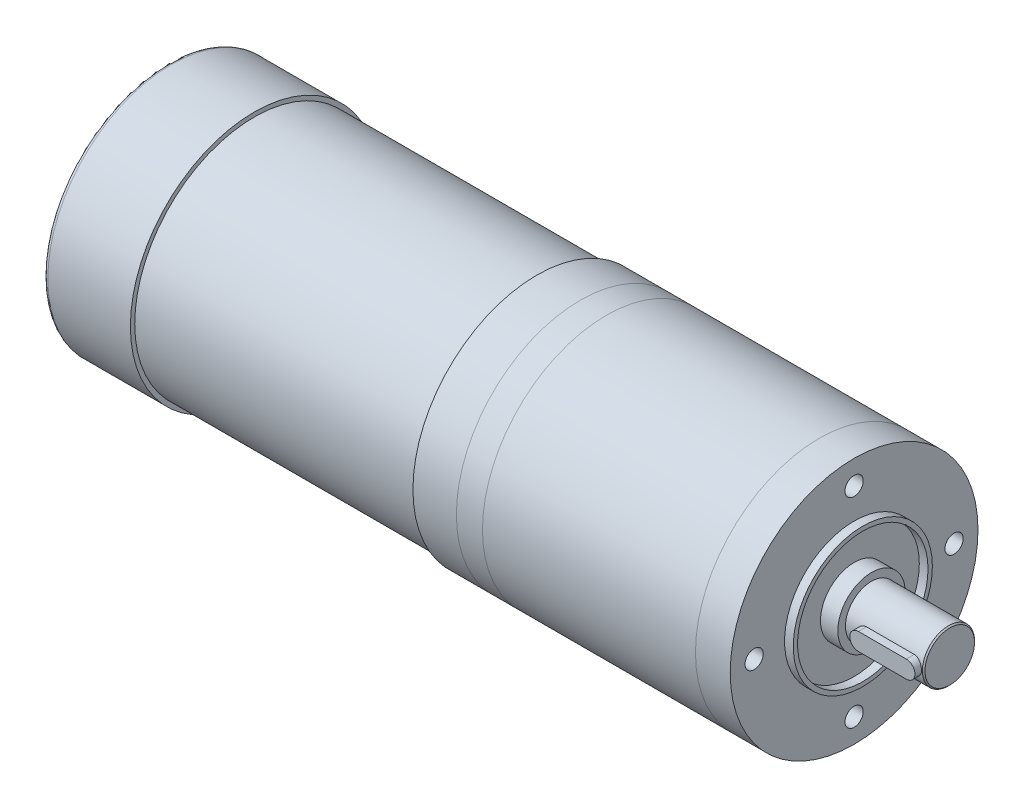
ISO-10303-21;
HEADER;
FILE_DESCRIPTION(('STEP AP214'),'2;1');
FILE_NAME('part.step','',(''),(''),'','','');
FILE_SCHEMA(('AUTOMOTIVE_DESIGN { 1 0 10303 214 1 1 1 1 }'));
ENDSEC;
DATA;
#1=APPLICATION_CONTEXT('core data for automotive mechanical design processes');
#2=APPLICATION_PROTOCOL_DEFINITION('international standard','automotive_design',2000,#1);
#3=PRODUCT_CONTEXT('',#1,'mechanical');
#4=PRODUCT('Part','Part','',(#3));
#5=PRODUCT_RELATED_PRODUCT_CATEGORY('part','',(#4));
#6=PRODUCT_DEFINITION_FORMATION('','',#4);
#7=PRODUCT_DEFINITION_CONTEXT('part definition',#1,'design');
#8=PRODUCT_DEFINITION('design','',#6,#7);
#9=PRODUCT_DEFINITION_SHAPE('','',#8);
#10=(LENGTH_UNIT() NAMED_UNIT(*) SI_UNIT(.MILLI.,.METRE.));
#11=(NAMED_UNIT(*) PLANE_ANGLE_UNIT() SI_UNIT($,.RADIAN.));
#12=(NAMED_UNIT(*) SI_UNIT($,.STERADIAN.) SOLID_ANGLE_UNIT());
#13=UNCERTAINTY_MEASURE_WITH_UNIT(LENGTH_MEASURE(1.E-05),#10,'distance_accuracy_value','');
#14=(GEOMETRIC_REPRESENTATION_CONTEXT(3) GLOBAL_UNCERTAINTY_ASSIGNED_CONTEXT((#13)) GLOBAL_UNIT_ASSIGNED_CONTEXT((#10,
#11,#12)) REPRESENTATION_CONTEXT('',''));
#15=CARTESIAN_POINT('',(0.,0.,0.));
#16=DIRECTION('',(0.,0.,1.));
#17=DIRECTION('',(1.,0.,0.));
#18=AXIS2_PLACEMENT_3D('',#15,#16,#17);
#19=CARTESIAN_POINT('',(8.5,0.,7.5));
#20=DIRECTION('',(0.,0.,-1.));
#21=DIRECTION('',(-1.,0.,0.));
#22=AXIS2_PLACEMENT_3D('',#19,#20,#21);
#23=CYLINDRICAL_SURFACE('',#22,2.);
#24=CARTESIAN_POINT('',(8.5,0.,3.5));
#25=DIRECTION('',(0.,0.,1.));
#26=DIRECTION('',(1.,0.,0.));
#27=AXIS2_PLACEMENT_3D('',#24,#25,#26);
#28=CIRCLE('',#27,2.);
#29=CARTESIAN_POINT('',(8.5,2.,3.5));
#30=VERTEX_POINT('',#29);
#31=CARTESIAN_POINT('',(8.5,-2.,3.5));
#32=VERTEX_POINT('',#31);
#33=EDGE_CURVE('E111',#30,#32,#28,.T.);
#34=ORIENTED_EDGE('',*,*,#33,.T.);
#35=DIRECTION('',(0.,0.,-1.));
#36=VECTOR('',#35,1.);
#37=CARTESIAN_POINT('',(8.5,-2.,7.5));
#38=LINE('',#37,#36);
#39=CARTESIAN_POINT('',(8.5,-2.,7.5));
#40=VERTEX_POINT('',#39);
#41=EDGE_CURVE('E12',#40,#32,#38,.T.);
#42=ORIENTED_EDGE('',*,*,#41,.F.);
#43=CARTESIAN_POINT('',(8.5,0.,7.5));
#44=DIRECTION('',(0.,0.,1.));
#45=DIRECTION('',(1.,0.,0.));
#46=AXIS2_PLACEMENT_3D('',#43,#44,#45);
#47=CIRCLE('',#46,2.);
#48=CARTESIAN_POINT('',(8.5,2.,7.5));
#49=VERTEX_POINT('',#48);
#50=EDGE_CURVE('E99',#49,#40,#47,.T.);
#51=ORIENTED_EDGE('',*,*,#50,.F.);
#52=DIRECTION('',(0.,0.,-1.));
#53=VECTOR('',#52,1.);
#54=CARTESIAN_POINT('',(8.5,2.,7.5));
#55=LINE('',#54,#53);
#56=EDGE_CURVE('E107',#49,#30,#55,.T.);
#57=ORIENTED_EDGE('',*,*,#56,.T.);
#58=EDGE_LOOP('',(#34,#42,#51,#57));
#59=FACE_BOUND('',#58,.T.);
#60=ADVANCED_FACE('F48',(#59),#23,.T.);
#61=CARTESIAN_POINT('',(19.5,-2.,7.5));
#62=DIRECTION('',(0.,1.,0.));
#63=DIRECTION('',(-1.,0.,0.));
#64=AXIS2_PLACEMENT_3D('',#61,#62,#63);
#65=PLANE('',#64);
#66=DIRECTION('',(1.,0.,0.));
#67=VECTOR('',#66,1.);
#68=CARTESIAN_POINT('',(19.5,-2.,3.5));
#69=LINE('',#68,#67);
#70=CARTESIAN_POINT('',(19.5,-2.,3.5));
#71=VERTEX_POINT('',#70);
#72=EDGE_CURVE('E103',#32,#71,#69,.T.);
#73=ORIENTED_EDGE('',*,*,#72,.T.);
#74=DIRECTION('',(0.,0.,-1.));
#75=VECTOR('',#74,1.);
#76=CARTESIAN_POINT('',(19.5,-2.,7.5));
#77=LINE('',#76,#75);
#78=CARTESIAN_POINT('',(19.5,-2.,7.5));
#79=VERTEX_POINT('',#78);
#80=EDGE_CURVE('E56',#79,#71,#77,.T.);
#81=ORIENTED_EDGE('',*,*,#80,.F.);
#82=DIRECTION('',(1.,0.,0.));
#83=VECTOR('',#82,1.);
#84=CARTESIAN_POINT('',(19.5,-2.,7.5));
#85=LINE('',#84,#83);
#86=EDGE_CURVE('E94',#40,#79,#85,.T.);
#87=ORIENTED_EDGE('',*,*,#86,.F.);
#88=ORIENTED_EDGE('',*,*,#41,.T.);
#89=EDGE_LOOP('',(#73,#81,#87,#88));
#90=FACE_BOUND('',#89,.T.);
#91=ADVANCED_FACE('F102',(#90),#65,.F.);
#92=CARTESIAN_POINT('',(19.5,0.,7.5));
#93=DIRECTION('',(0.,0.,-1.));
#94=DIRECTION('',(-1.,0.,0.));
#95=AXIS2_PLACEMENT_3D('',#92,#93,#94);
#96=CYLINDRICAL_SURFACE('',#95,2.);
#97=CARTESIAN_POINT('',(19.5,0.,3.5));
#98=DIRECTION('',(0.,0.,1.));
#99=DIRECTION('',(1.,0.,0.));
#100=AXIS2_PLACEMENT_3D('',#97,#98,#99);
#101=CIRCLE('',#100,2.);
#102=CARTESIAN_POINT('',(19.5,2.,3.5));
#103=VERTEX_POINT('',#102);
#104=EDGE_CURVE('E81',#71,#103,#101,.T.);
#105=ORIENTED_EDGE('',*,*,#104,.T.);
#106=DIRECTION('',(0.,0.,-1.));
#107=VECTOR('',#106,1.);
#108=CARTESIAN_POINT('',(19.5,2.,7.5));
#109=LINE('',#108,#107);
#110=CARTESIAN_POINT('',(19.5,2.,7.5));
#111=VERTEX_POINT('',#110);
#112=EDGE_CURVE('E104',#111,#103,#109,.T.);
#113=ORIENTED_EDGE('',*,*,#112,.F.);
#114=CARTESIAN_POINT('',(19.5,0.,7.5));
#115=DIRECTION('',(0.,0.,1.));
#116=DIRECTION('',(1.,0.,0.));
#117=AXIS2_PLACEMENT_3D('',#114,#115,#116);
#118=CIRCLE('',#117,2.);
#119=EDGE_CURVE('E97',#79,#111,#118,.T.);
#120=ORIENTED_EDGE('',*,*,#119,.F.);
#121=ORIENTED_EDGE('',*,*,#80,.T.);
#122=EDGE_LOOP('',(#105,#113,#120,#121));
#123=FACE_BOUND('',#122,.T.);
#124=ADVANCED_FACE('F105',(#123),#96,.T.);
#125=CARTESIAN_POINT('',(8.5,2.,7.5));
#126=DIRECTION('',(0.,-1.,0.));
#127=DIRECTION('',(1.,0.,0.));
#128=AXIS2_PLACEMENT_3D('',#125,#126,#127);
#129=PLANE('',#128);
#130=DIRECTION('',(-1.,0.,0.));
#131=VECTOR('',#130,1.);
#132=CARTESIAN_POINT('',(8.5,2.,3.5));
#133=LINE('',#132,#131);
#134=EDGE_CURVE('E87',#103,#30,#133,.T.);
#135=ORIENTED_EDGE('',*,*,#134,.T.);
#136=ORIENTED_EDGE('',*,*,#56,.F.);
#137=DIRECTION('',(-1.,0.,0.));
#138=VECTOR('',#137,1.);
#139=CARTESIAN_POINT('',(8.5,2.,7.5));
#140=LINE('',#139,#138);
#141=EDGE_CURVE('E64',#111,#49,#140,.T.);
#142=ORIENTED_EDGE('',*,*,#141,.F.);
#143=ORIENTED_EDGE('',*,*,#112,.T.);
#144=EDGE_LOOP('',(#135,#136,#142,#143));
#145=FACE_BOUND('',#144,.T.);
#146=ADVANCED_FACE('F118',(#145),#129,.F.);
#147=CARTESIAN_POINT('',(8.5,0.,7.5));
#148=DIRECTION('',(0.,0.,1.));
#149=DIRECTION('',(1.,0.,0.));
#150=AXIS2_PLACEMENT_3D('',#147,#148,#149);
#151=PLANE('',#150);
#152=ORIENTED_EDGE('',*,*,#50,.T.);
#153=ORIENTED_EDGE('',*,*,#86,.T.);
#154=ORIENTED_EDGE('',*,*,#119,.T.);
#155=ORIENTED_EDGE('',*,*,#141,.T.);
#156=EDGE_LOOP('',(#152,#153,#154,#155));
#157=FACE_BOUND('',#156,.T.);
#158=ADVANCED_FACE('F95',(#157),#151,.T.);
#159=CARTESIAN_POINT('',(8.5,0.,3.5));
#160=DIRECTION('',(0.,0.,1.));
#161=DIRECTION('',(1.,0.,0.));
#162=AXIS2_PLACEMENT_3D('',#159,#160,#161);
#163=PLANE('',#162);
#164=ORIENTED_EDGE('',*,*,#33,.F.);
#165=ORIENTED_EDGE('',*,*,#134,.F.);
#166=ORIENTED_EDGE('',*,*,#104,.F.);
#167=ORIENTED_EDGE('',*,*,#72,.F.);
#168=EDGE_LOOP('',(#164,#165,#166,#167));
#169=FACE_BOUND('',#168,.T.);
#170=ADVANCED_FACE('F121',(#169),#163,.F.);
#171=CLOSED_SHELL('',(#60,#91,#124,#146,#158,#170));
#172=MANIFOLD_SOLID_BREP('B2',#171);
#173=CARTESIAN_POINT('',(-73.,0.,0.));
#174=DIRECTION('',(-1.,0.,0.));
#175=DIRECTION('',(0.,0.,1.));
#176=AXIS2_PLACEMENT_3D('',#173,#174,#175);
#177=PLANE('',#176);
#178=CARTESIAN_POINT('',(-73.,0.,0.));
#179=DIRECTION('',(-1.,0.,0.));
#180=DIRECTION('',(0.,0.,1.));
#181=AXIS2_PLACEMENT_3D('',#178,#179,#180);
#182=CIRCLE('',#181,28.5);
#183=CARTESIAN_POINT('',(-73.,0.,28.5));
#184=VERTEX_POINT('',#183);
#185=EDGE_CURVE('E191',#184,#184,#182,.T.);
#186=ORIENTED_EDGE('',*,*,#185,.T.);
#187=EDGE_LOOP('',(#186));
#188=FACE_BOUND('',#187,.T.);
#189=CARTESIAN_POINT('',(-73.,0.,0.));
#190=DIRECTION('',(-1.,0.,0.));
#191=DIRECTION('',(0.,0.,1.));
#192=AXIS2_PLACEMENT_3D('',#189,#190,#191);
#193=CIRCLE('',#192,27.5);
#194=CARTESIAN_POINT('',(-73.,0.,27.5));
#195=VERTEX_POINT('',#194);
#196=EDGE_CURVE('E201',#195,#195,#193,.T.);
#197=ORIENTED_EDGE('',*,*,#196,.F.);
#198=EDGE_LOOP('',(#197));
#199=FACE_BOUND('',#198,.T.);
#200=ADVANCED_FACE('F180',(#188,#199),#177,.T.);
#201=CARTESIAN_POINT('',(-73.,0.,0.));
#202=DIRECTION('',(1.,0.,0.));
#203=DIRECTION('',(0.,0.,-1.));
#204=AXIS2_PLACEMENT_3D('',#201,#202,#203);
#205=CYLINDRICAL_SURFACE('',#204,28.5);
#206=ORIENTED_EDGE('',*,*,#185,.F.);
#207=EDGE_LOOP('',(#206));
#208=FACE_BOUND('',#207,.T.);
#209=CARTESIAN_POINT('',(-63.,0.,0.));
#210=DIRECTION('',(-1.,0.,0.));
#211=DIRECTION('',(0.,0.,1.));
#212=AXIS2_PLACEMENT_3D('',#209,#210,#211);
#213=CIRCLE('',#212,28.5);
#214=CARTESIAN_POINT('',(-63.,0.,28.5));
#215=VERTEX_POINT('',#214);
#216=EDGE_CURVE('E195',#215,#215,#213,.T.);
#217=ORIENTED_EDGE('',*,*,#216,.T.);
#218=EDGE_LOOP('',(#217));
#219=FACE_BOUND('',#218,.T.);
#220=ADVANCED_FACE('F226',(#208,#219),#205,.T.);
#221=CARTESIAN_POINT('',(-63.,0.,0.));
#222=DIRECTION('',(-1.,0.,0.));
#223=DIRECTION('',(0.,0.,1.));
#224=AXIS2_PLACEMENT_3D('',#221,#222,#223);
#225=PLANE('',#224);
#226=ORIENTED_EDGE('',*,*,#216,.F.);
#227=EDGE_LOOP('',(#226));
#228=FACE_BOUND('',#227,.T.);
#229=ADVANCED_FACE('F221',(#228),#225,.F.);
#230=CARTESIAN_POINT('',(-138.,0.,0.));
#231=DIRECTION('',(1.,0.,0.));
#232=DIRECTION('',(0.,0.,-1.));
#233=AXIS2_PLACEMENT_3D('',#230,#231,#232);
#234=CYLINDRICAL_SURFACE('',#233,27.5);
#235=CARTESIAN_POINT('',(-138.,0.,0.));
#236=DIRECTION('',(-1.,0.,0.));
#237=DIRECTION('',(0.,0.,1.));
#238=AXIS2_PLACEMENT_3D('',#235,#236,#237);
#239=CIRCLE('',#238,27.5);
#240=CARTESIAN_POINT('',(-138.,0.,27.5));
#241=VERTEX_POINT('',#240);
#242=EDGE_CURVE('E199',#241,#241,#239,.T.);
#243=ORIENTED_EDGE('',*,*,#242,.F.);
#244=EDGE_LOOP('',(#243));
#245=FACE_BOUND('',#244,.T.);
#246=ORIENTED_EDGE('',*,*,#196,.T.);
#247=EDGE_LOOP('',(#246));
#248=FACE_BOUND('',#247,.T.);
#249=ADVANCED_FACE('F215',(#245,#248),#234,.T.);
#250=CARTESIAN_POINT('',(-138.,0.,0.));
#251=DIRECTION('',(-1.,0.,0.));
#252=DIRECTION('',(0.,0.,1.));
#253=AXIS2_PLACEMENT_3D('',#250,#251,#252);
#254=PLANE('',#253);
#255=CARTESIAN_POINT('',(-138.,0.,0.));
#256=DIRECTION('',(-1.,0.,0.));
#257=DIRECTION('',(0.,0.,1.));
#258=AXIS2_PLACEMENT_3D('',#255,#256,#257);
#259=CIRCLE('',#258,28.5);
#260=CARTESIAN_POINT('',(-138.,0.,28.5));
#261=VERTEX_POINT('',#260);
#262=EDGE_CURVE('E204',#261,#261,#259,.T.);
#263=ORIENTED_EDGE('',*,*,#262,.F.);
#264=EDGE_LOOP('',(#263));
#265=FACE_BOUND('',#264,.T.);
#266=ORIENTED_EDGE('',*,*,#242,.T.);
#267=EDGE_LOOP('',(#266));
#268=FACE_BOUND('',#267,.T.);
#269=ADVANCED_FACE('F212',(#265,#268),#254,.F.);
#270=CARTESIAN_POINT('',(-158.,0.,0.));
#271=DIRECTION('',(1.,0.,0.));
#272=DIRECTION('',(0.,0.,-1.));
#273=AXIS2_PLACEMENT_3D('',#270,#271,#272);
#274=CYLINDRICAL_SURFACE('',#273,28.5);
#275=CARTESIAN_POINT('',(-157.,0.,0.));
#276=DIRECTION('',(-1.,0.,0.));
#277=DIRECTION('',(0.,0.,1.));
#278=AXIS2_PLACEMENT_3D('',#275,#276,#277);
#279=CIRCLE('',#278,28.5);
#280=CARTESIAN_POINT('',(-157.,0.,28.5));
#281=VERTEX_POINT('',#280);
#282=EDGE_CURVE('E47',#281,#281,#279,.F.);
#283=ORIENTED_EDGE('',*,*,#282,.T.);
#284=EDGE_LOOP('',(#283));
#285=FACE_BOUND('',#284,.T.);
#286=ORIENTED_EDGE('',*,*,#262,.T.);
#287=EDGE_LOOP('',(#286));
#288=FACE_BOUND('',#287,.T.);
#289=ADVANCED_FACE('F210',(#285,#288),#274,.T.);
#290=CARTESIAN_POINT('',(-158.,0.,0.));
#291=DIRECTION('',(-1.,0.,0.));
#292=DIRECTION('',(0.,0.,1.));
#293=AXIS2_PLACEMENT_3D('',#290,#291,#292);
#294=PLANE('',#293);
#295=CARTESIAN_POINT('',(-158.,0.,0.));
#296=DIRECTION('',(-1.,0.,0.));
#297=DIRECTION('',(0.,0.,1.));
#298=AXIS2_PLACEMENT_3D('',#295,#296,#297);
#299=CIRCLE('',#298,27.5);
#300=CARTESIAN_POINT('',(-158.,0.,27.5));
#301=VERTEX_POINT('',#300);
#302=EDGE_CURVE('E187',#301,#301,#299,.T.);
#303=ORIENTED_EDGE('',*,*,#302,.T.);
#304=EDGE_LOOP('',(#303));
#305=FACE_BOUND('',#304,.T.);
#306=ADVANCED_FACE('F257',(#305),#294,.T.);
#307=CARTESIAN_POINT('',(-157.,0.,0.));
#308=DIRECTION('',(-1.,0.,0.));
#309=DIRECTION('',(0.,0.,1.));
#310=AXIS2_PLACEMENT_3D('',#307,#308,#309);
#311=TOROIDAL_SURFACE('',#310,27.5,1.);
#312=ORIENTED_EDGE('',*,*,#282,.F.);
#313=EDGE_LOOP('',(#312));
#314=FACE_BOUND('',#313,.T.);
#315=ORIENTED_EDGE('',*,*,#302,.F.);
#316=EDGE_LOOP('',(#315));
#317=FACE_BOUND('',#316,.T.);
#318=ADVANCED_FACE('F182',(#314,#317),#311,.T.);
#319=CLOSED_SHELL('',(#200,#220,#229,#249,#269,#289,#306,#318));
#320=MANIFOLD_SOLID_BREP('B6',#319);
#321=CARTESIAN_POINT('',(-63.,0.,0.));
#322=DIRECTION('',(1.,0.,0.));
#323=DIRECTION('',(0.,0.,-1.));
#324=AXIS2_PLACEMENT_3D('',#321,#322,#323);
#325=CYLINDRICAL_SURFACE('',#324,28.5);
#326=CARTESIAN_POINT('',(-63.,0.,0.));
#327=DIRECTION('',(-1.,0.,0.));
#328=DIRECTION('',(0.,0.,1.));
#329=AXIS2_PLACEMENT_3D('',#326,#327,#328);
#330=CIRCLE('',#329,28.5);
#331=CARTESIAN_POINT('',(-63.,0.,28.5));
#332=VERTEX_POINT('',#331);
#333=EDGE_CURVE('E179',#332,#332,#330,.T.);
#334=ORIENTED_EDGE('',*,*,#333,.F.);
#335=EDGE_LOOP('',(#334));
#336=FACE_BOUND('',#335,.T.);
#337=CARTESIAN_POINT('',(-57.,0.,0.));
#338=DIRECTION('',(-1.,0.,0.));
#339=DIRECTION('',(0.,0.,1.));
#340=AXIS2_PLACEMENT_3D('',#337,#338,#339);
#341=CIRCLE('',#340,28.5);
#342=CARTESIAN_POINT('',(-57.,0.,28.5));
#343=VERTEX_POINT('',#342);
#344=EDGE_CURVE('E309',#343,#343,#341,.T.);
#345=ORIENTED_EDGE('',*,*,#344,.T.);
#346=EDGE_LOOP('',(#345));
#347=FACE_BOUND('',#346,.T.);
#348=ADVANCED_FACE('F306',(#336,#347),#325,.T.);
#349=CARTESIAN_POINT('',(-63.,0.,0.));
#350=DIRECTION('',(-1.,0.,0.));
#351=DIRECTION('',(0.,0.,1.));
#352=AXIS2_PLACEMENT_3D('',#349,#350,#351);
#353=PLANE('',#352);
#354=ORIENTED_EDGE('',*,*,#333,.T.);
#355=EDGE_LOOP('',(#354));
#356=FACE_BOUND('',#355,.T.);
#357=ADVANCED_FACE('F321',(#356),#353,.T.);
#358=CARTESIAN_POINT('',(-57.,0.,0.));
#359=DIRECTION('',(-1.,0.,0.));
#360=DIRECTION('',(0.,0.,1.));
#361=AXIS2_PLACEMENT_3D('',#358,#359,#360);
#362=PLANE('',#361);
#363=ORIENTED_EDGE('',*,*,#344,.F.);
#364=EDGE_LOOP('',(#363));
#365=FACE_BOUND('',#364,.T.);
#366=ADVANCED_FACE('F319',(#365),#362,.F.);
#367=CLOSED_SHELL('',(#348,#357,#366));
#368=MANIFOLD_SOLID_BREP('B42',#367);
#369=CARTESIAN_POINT('',(-57.,0.,0.));
#370=DIRECTION('',(1.,0.,0.));
#371=DIRECTION('',(0.,0.,-1.));
#372=AXIS2_PLACEMENT_3D('',#369,#370,#371);
#373=CYLINDRICAL_SURFACE('',#372,28.5);
#374=CARTESIAN_POINT('',(-57.,0.,0.));
#375=DIRECTION('',(-1.,0.,0.));
#376=DIRECTION('',(0.,0.,1.));
#377=AXIS2_PLACEMENT_3D('',#374,#375,#376);
#378=CIRCLE('',#377,28.5);
#379=CARTESIAN_POINT('',(-57.,0.,28.5));
#380=VERTEX_POINT('',#379);
#381=EDGE_CURVE('E304',#380,#380,#378,.T.);
#382=ORIENTED_EDGE('',*,*,#381,.F.);
#383=EDGE_LOOP('',(#382));
#384=FACE_BOUND('',#383,.T.);
#385=CARTESIAN_POINT('',(-8.,0.,0.));
#386=DIRECTION('',(-1.,0.,0.));
#387=DIRECTION('',(0.,0.,1.));
#388=AXIS2_PLACEMENT_3D('',#385,#386,#387);
#389=CIRCLE('',#388,28.5);
#390=CARTESIAN_POINT('',(-8.,0.,28.5));
#391=VERTEX_POINT('',#390);
#392=EDGE_CURVE('E364',#391,#391,#389,.T.);
#393=ORIENTED_EDGE('',*,*,#392,.T.);
#394=EDGE_LOOP('',(#393));
#395=FACE_BOUND('',#394,.T.);
#396=ADVANCED_FACE('F356',(#384,#395),#373,.T.);
#397=CARTESIAN_POINT('',(-57.,0.,0.));
#398=DIRECTION('',(-1.,0.,0.));
#399=DIRECTION('',(0.,0.,1.));
#400=AXIS2_PLACEMENT_3D('',#397,#398,#399);
#401=PLANE('',#400);
#402=ORIENTED_EDGE('',*,*,#381,.T.);
#403=EDGE_LOOP('',(#402));
#404=FACE_BOUND('',#403,.T.);
#405=ADVANCED_FACE('F429',(#404),#401,.T.);
#406=CARTESIAN_POINT('',(-8.,0.,0.));
#407=DIRECTION('',(-1.,0.,0.));
#408=DIRECTION('',(0.,0.,1.));
#409=AXIS2_PLACEMENT_3D('',#406,#407,#408);
#410=PLANE('',#409);
#411=CARTESIAN_POINT('',(-8.,23.,0.));
#412=DIRECTION('',(-1.,0.,0.));
#413=DIRECTION('',(0.,0.,1.));
#414=AXIS2_PLACEMENT_3D('',#411,#412,#413);
#415=CIRCLE('',#414,2.1);
#416=CARTESIAN_POINT('',(-8.,23.,2.1));
#417=VERTEX_POINT('',#416);
#418=EDGE_CURVE('E359',#417,#417,#415,.T.);
#419=ORIENTED_EDGE('',*,*,#418,.T.);
#420=EDGE_LOOP('',(#419));
#421=FACE_BOUND('',#420,.T.);
#422=CARTESIAN_POINT('',(-8.,0.,-23.));
#423=DIRECTION('',(-1.,0.,0.));
#424=DIRECTION('',(0.,0.,1.));
#425=AXIS2_PLACEMENT_3D('',#422,#423,#424);
#426=CIRCLE('',#425,2.1);
#427=CARTESIAN_POINT('',(-8.,0.,-20.9));
#428=VERTEX_POINT('',#427);
#429=EDGE_CURVE('E393',#428,#428,#426,.T.);
#430=ORIENTED_EDGE('',*,*,#429,.T.);
#431=EDGE_LOOP('',(#430));
#432=FACE_BOUND('',#431,.T.);
#433=CARTESIAN_POINT('',(-8.,-23.,0.));
#434=DIRECTION('',(-1.,0.,0.));
#435=DIRECTION('',(0.,0.,1.));
#436=AXIS2_PLACEMENT_3D('',#433,#434,#435);
#437=CIRCLE('',#436,2.1);
#438=CARTESIAN_POINT('',(-8.,-23.,2.1));
#439=VERTEX_POINT('',#438);
#440=EDGE_CURVE('E397',#439,#439,#437,.T.);
#441=ORIENTED_EDGE('',*,*,#440,.T.);
#442=EDGE_LOOP('',(#441));
#443=FACE_BOUND('',#442,.T.);
#444=CARTESIAN_POINT('',(-8.,0.,23.));
#445=DIRECTION('',(-1.,0.,0.));
#446=DIRECTION('',(0.,0.,1.));
#447=AXIS2_PLACEMENT_3D('',#444,#445,#446);
#448=CIRCLE('',#447,2.1);
#449=CARTESIAN_POINT('',(-8.,0.,25.1));
#450=VERTEX_POINT('',#449);
#451=EDGE_CURVE('E400',#450,#450,#448,.T.);
#452=ORIENTED_EDGE('',*,*,#451,.T.);
#453=EDGE_LOOP('',(#452));
#454=FACE_BOUND('',#453,.T.);
#455=ORIENTED_EDGE('',*,*,#392,.F.);
#456=EDGE_LOOP('',(#455));
#457=FACE_BOUND('',#456,.T.);
#458=ADVANCED_FACE('F410',(#421,#432,#443,#454,#457),#410,.F.);
#459=CARTESIAN_POINT('',(0.,0.,23.));
#460=DIRECTION('',(1.,0.,0.));
#461=DIRECTION('',(0.,0.,-1.));
#462=AXIS2_PLACEMENT_3D('',#459,#460,#461);
#463=CYLINDRICAL_SURFACE('',#462,2.1);
#464=CARTESIAN_POINT('',(-14.,0.,23.));
#465=DIRECTION('',(1.,0.,0.));
#466=DIRECTION('',(0.,0.,-1.));
#467=AXIS2_PLACEMENT_3D('',#464,#465,#466);
#468=CIRCLE('',#467,2.1);
#469=CARTESIAN_POINT('',(-14.,0.,20.9));
#470=VERTEX_POINT('',#469);
#471=EDGE_CURVE('E398',#470,#470,#468,.T.);
#472=ORIENTED_EDGE('',*,*,#471,.F.);
#473=EDGE_LOOP('',(#472));
#474=FACE_BOUND('',#473,.T.);
#475=ORIENTED_EDGE('',*,*,#451,.F.);
#476=EDGE_LOOP('',(#475));
#477=FACE_BOUND('',#476,.T.);
#478=ADVANCED_FACE('F441',(#474,#477),#463,.F.);
#479=CARTESIAN_POINT('',(-14.,0.,23.));
#480=DIRECTION('',(1.,0.,0.));
#481=DIRECTION('',(0.,0.,-1.));
#482=AXIS2_PLACEMENT_3D('',#479,#480,#481);
#483=CONICAL_SURFACE('',#482,2.1,1.02974425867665);
#484=CARTESIAN_POINT('',(-15.2618072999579,0.,23.));
#485=VERTEX_POINT('',#484);
#486=VERTEX_LOOP('',#485);
#487=FACE_BOUND('',#486,.T.);
#488=ORIENTED_EDGE('',*,*,#471,.T.);
#489=EDGE_LOOP('',(#488));
#490=FACE_BOUND('',#489,.T.);
#491=ADVANCED_FACE('F446',(#487,#490),#483,.F.);
#492=CARTESIAN_POINT('',(0.,-23.,0.));
#493=DIRECTION('',(1.,0.,0.));
#494=DIRECTION('',(0.,0.,-1.));
#495=AXIS2_PLACEMENT_3D('',#492,#493,#494);
#496=CYLINDRICAL_SURFACE('',#495,2.1);
#497=CARTESIAN_POINT('',(-14.,-23.,0.));
#498=DIRECTION('',(1.,0.,0.));
#499=DIRECTION('',(0.,0.,-1.));
#500=AXIS2_PLACEMENT_3D('',#497,#498,#499);
#501=CIRCLE('',#500,2.1);
#502=CARTESIAN_POINT('',(-14.,-23.,-2.1));
#503=VERTEX_POINT('',#502);
#504=EDGE_CURVE('E394',#503,#503,#501,.T.);
#505=ORIENTED_EDGE('',*,*,#504,.F.);
#506=EDGE_LOOP('',(#505));
#507=FACE_BOUND('',#506,.T.);
#508=ORIENTED_EDGE('',*,*,#440,.F.);
#509=EDGE_LOOP('',(#508));
#510=FACE_BOUND('',#509,.T.);
#511=ADVANCED_FACE('F425',(#507,#510),#496,.F.);
#512=CARTESIAN_POINT('',(-14.,-23.,0.));
#513=DIRECTION('',(1.,0.,0.));
#514=DIRECTION('',(0.,0.,-1.));
#515=AXIS2_PLACEMENT_3D('',#512,#513,#514);
#516=CONICAL_SURFACE('',#515,2.1,1.02974425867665);
#517=CARTESIAN_POINT('',(-15.2618072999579,-23.,0.));
#518=VERTEX_POINT('',#517);
#519=VERTEX_LOOP('',#518);
#520=FACE_BOUND('',#519,.T.);
#521=ORIENTED_EDGE('',*,*,#504,.T.);
#522=EDGE_LOOP('',(#521));
#523=FACE_BOUND('',#522,.T.);
#524=ADVANCED_FACE('F416',(#520,#523),#516,.F.);
#525=CARTESIAN_POINT('',(0.,0.,-23.));
#526=DIRECTION('',(1.,0.,0.));
#527=DIRECTION('',(0.,0.,-1.));
#528=AXIS2_PLACEMENT_3D('',#525,#526,#527);
#529=CYLINDRICAL_SURFACE('',#528,2.1);
#530=CARTESIAN_POINT('',(-14.,0.,-23.));
#531=DIRECTION('',(1.,0.,0.));
#532=DIRECTION('',(0.,0.,-1.));
#533=AXIS2_PLACEMENT_3D('',#530,#531,#532);
#534=CIRCLE('',#533,2.1);
#535=CARTESIAN_POINT('',(-14.,0.,-25.1));
#536=VERTEX_POINT('',#535);
#537=EDGE_CURVE('E389',#536,#536,#534,.T.);
#538=ORIENTED_EDGE('',*,*,#537,.F.);
#539=EDGE_LOOP('',(#538));
#540=FACE_BOUND('',#539,.T.);
#541=ORIENTED_EDGE('',*,*,#429,.F.);
#542=EDGE_LOOP('',(#541));
#543=FACE_BOUND('',#542,.T.);
#544=ADVANCED_FACE('F413',(#540,#543),#529,.F.);
#545=CARTESIAN_POINT('',(-14.,0.,-23.));
#546=DIRECTION('',(1.,0.,0.));
#547=DIRECTION('',(0.,0.,-1.));
#548=AXIS2_PLACEMENT_3D('',#545,#546,#547);
#549=CONICAL_SURFACE('',#548,2.1,1.02974425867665);
#550=CARTESIAN_POINT('',(-15.2618072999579,0.,-23.));
#551=VERTEX_POINT('',#550);
#552=VERTEX_LOOP('',#551);
#553=FACE_BOUND('',#552,.T.);
#554=ORIENTED_EDGE('',*,*,#537,.T.);
#555=EDGE_LOOP('',(#554));
#556=FACE_BOUND('',#555,.T.);
#557=ADVANCED_FACE('F415',(#553,#556),#549,.F.);
#558=CARTESIAN_POINT('',(0.,23.,0.));
#559=DIRECTION('',(1.,0.,0.));
#560=DIRECTION('',(0.,0.,-1.));
#561=AXIS2_PLACEMENT_3D('',#558,#559,#560);
#562=CYLINDRICAL_SURFACE('',#561,2.1);
#563=CARTESIAN_POINT('',(-14.,23.,0.));
#564=DIRECTION('',(1.,0.,0.));
#565=DIRECTION('',(0.,0.,-1.));
#566=AXIS2_PLACEMENT_3D('',#563,#564,#565);
#567=CIRCLE('',#566,2.1);
#568=CARTESIAN_POINT('',(-14.,23.,-2.1));
#569=VERTEX_POINT('',#568);
#570=EDGE_CURVE('E385',#569,#569,#567,.T.);
#571=ORIENTED_EDGE('',*,*,#570,.F.);
#572=EDGE_LOOP('',(#571));
#573=FACE_BOUND('',#572,.T.);
#574=ORIENTED_EDGE('',*,*,#418,.F.);
#575=EDGE_LOOP('',(#574));
#576=FACE_BOUND('',#575,.T.);
#577=ADVANCED_FACE('F381',(#573,#576),#562,.F.);
#578=CARTESIAN_POINT('',(-14.,23.,0.));
#579=DIRECTION('',(1.,0.,0.));
#580=DIRECTION('',(0.,0.,-1.));
#581=AXIS2_PLACEMENT_3D('',#578,#579,#580);
#582=CONICAL_SURFACE('',#581,2.1,1.02974425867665);
#583=CARTESIAN_POINT('',(-15.2618072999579,23.,0.));
#584=VERTEX_POINT('',#583);
#585=VERTEX_LOOP('',#584);
#586=FACE_BOUND('',#585,.T.);
#587=ORIENTED_EDGE('',*,*,#570,.T.);
#588=EDGE_LOOP('',(#587));
#589=FACE_BOUND('',#588,.T.);
#590=ADVANCED_FACE('F378',(#586,#589),#582,.F.);
#591=CLOSED_SHELL('',(#396,#405,#458,#478,#491,#511,#524,#544,#557,#577,#590));
#592=MANIFOLD_SOLID_BREP('B174',#591);
#593=CARTESIAN_POINT('',(4.,0.,0.));
#594=DIRECTION('',(1.,0.,0.));
#595=DIRECTION('',(0.,0.,-1.));
#596=AXIS2_PLACEMENT_3D('',#593,#594,#595);
#597=PLANE('',#596);
#598=CARTESIAN_POINT('',(4.,0.,0.));
#599=DIRECTION('',(1.,0.,0.));
#600=DIRECTION('',(0.,0.,-1.));
#601=AXIS2_PLACEMENT_3D('',#598,#599,#600);
#602=CIRCLE('',#601,7.75);
#603=CARTESIAN_POINT('',(4.,0.,-7.75));
#604=VERTEX_POINT('',#603);
#605=EDGE_CURVE('E642',#604,#604,#602,.T.);
#606=ORIENTED_EDGE('',*,*,#605,.T.);
#607=EDGE_LOOP('',(#606));
#608=FACE_BOUND('',#607,.T.);
#609=CARTESIAN_POINT('',(4.,0.,0.));
#610=DIRECTION('',(1.,0.,0.));
#611=DIRECTION('',(0.,0.,-1.));
#612=AXIS2_PLACEMENT_3D('',#609,#610,#611);
#613=CIRCLE('',#612,6.);
#614=CARTESIAN_POINT('',(4.,0.,-6.));
#615=VERTEX_POINT('',#614);
#616=EDGE_CURVE('E638',#615,#615,#613,.T.);
#617=ORIENTED_EDGE('',*,*,#616,.F.);
#618=EDGE_LOOP('',(#617));
#619=FACE_BOUND('',#618,.T.);
#620=ADVANCED_FACE('F547',(#608,#619),#597,.T.);
#621=CARTESIAN_POINT('',(0.,0.,0.));
#622=DIRECTION('',(1.,0.,0.));
#623=DIRECTION('',(0.,0.,-1.));
#624=AXIS2_PLACEMENT_3D('',#621,#622,#623);
#625=PLANE('',#624);
#626=CARTESIAN_POINT('',(0.,0.,0.));
#627=DIRECTION('',(1.,0.,0.));
#628=DIRECTION('',(0.,0.,-1.));
#629=AXIS2_PLACEMENT_3D('',#626,#627,#628);
#630=CIRCLE('',#629,15.);
#631=CARTESIAN_POINT('',(0.,0.,-15.));
#632=VERTEX_POINT('',#631);
#633=EDGE_CURVE('E660',#632,#632,#630,.F.);
#634=ORIENTED_EDGE('',*,*,#633,.F.);
#635=EDGE_LOOP('',(#634));
#636=FACE_BOUND('',#635,.T.);
#637=CARTESIAN_POINT('',(0.,0.,0.));
#638=DIRECTION('',(1.,0.,0.));
#639=DIRECTION('',(0.,0.,-1.));
#640=AXIS2_PLACEMENT_3D('',#637,#638,#639);
#641=CIRCLE('',#640,7.75);
#642=CARTESIAN_POINT('',(0.,0.,-7.75));
#643=VERTEX_POINT('',#642);
#644=EDGE_CURVE('E641',#643,#643,#641,.T.);
#645=ORIENTED_EDGE('',*,*,#644,.F.);
#646=EDGE_LOOP('',(#645));
#647=FACE_BOUND('',#646,.T.);
#648=ADVANCED_FACE('F723',(#636,#647),#625,.T.);
#649=CARTESIAN_POINT('',(0.,23.,0.));
#650=DIRECTION('',(1.,0.,0.));
#651=DIRECTION('',(0.,0.,-1.));
#652=AXIS2_PLACEMENT_3D('',#649,#650,#651);
#653=CIRCLE('',#652,2.1);
#654=CARTESIAN_POINT('',(0.,23.,-2.1));
#655=VERTEX_POINT('',#654);
#656=EDGE_CURVE('E615',#655,#655,#653,.T.);
#657=ORIENTED_EDGE('',*,*,#656,.F.);
#658=EDGE_LOOP('',(#657));
#659=FACE_BOUND('',#658,.T.);
#660=CARTESIAN_POINT('',(0.,0.,-23.));
#661=DIRECTION('',(1.,0.,0.));
#662=DIRECTION('',(0.,0.,-1.));
#663=AXIS2_PLACEMENT_3D('',#660,#661,#662);
#664=CIRCLE('',#663,2.1);
#665=CARTESIAN_POINT('',(0.,0.,-25.1));
#666=VERTEX_POINT('',#665);
#667=EDGE_CURVE('E624',#666,#666,#664,.T.);
#668=ORIENTED_EDGE('',*,*,#667,.F.);
#669=EDGE_LOOP('',(#668));
#670=FACE_BOUND('',#669,.T.);
#671=CARTESIAN_POINT('',(0.,-23.,0.));
#672=DIRECTION('',(1.,0.,0.));
#673=DIRECTION('',(0.,0.,-1.));
#674=AXIS2_PLACEMENT_3D('',#671,#672,#673);
#675=CIRCLE('',#674,2.1);
#676=CARTESIAN_POINT('',(0.,-23.,-2.1));
#677=VERTEX_POINT('',#676);
#678=EDGE_CURVE('E628',#677,#677,#675,.T.);
#679=ORIENTED_EDGE('',*,*,#678,.F.);
#680=EDGE_LOOP('',(#679));
#681=FACE_BOUND('',#680,.T.);
#682=CARTESIAN_POINT('',(0.,0.,23.));
#683=DIRECTION('',(1.,0.,0.));
#684=DIRECTION('',(0.,0.,-1.));
#685=AXIS2_PLACEMENT_3D('',#682,#683,#684);
#686=CIRCLE('',#685,2.1);
#687=CARTESIAN_POINT('',(0.,0.,20.9));
#688=VERTEX_POINT('',#687);
#689=EDGE_CURVE('E632',#688,#688,#686,.T.);
#690=ORIENTED_EDGE('',*,*,#689,.F.);
#691=EDGE_LOOP('',(#690));
#692=FACE_BOUND('',#691,.T.);
#693=CARTESIAN_POINT('',(0.,0.,0.));
#694=DIRECTION('',(1.,0.,0.));
#695=DIRECTION('',(0.,0.,-1.));
#696=AXIS2_PLACEMENT_3D('',#693,#694,#695);
#697=CIRCLE('',#696,28.5);
#698=CARTESIAN_POINT('',(0.,0.,-28.5));
#699=VERTEX_POINT('',#698);
#700=EDGE_CURVE('E654',#699,#699,#697,.T.);
#701=ORIENTED_EDGE('',*,*,#700,.T.);
#702=EDGE_LOOP('',(#701));
#703=FACE_BOUND('',#702,.T.);
#704=CARTESIAN_POINT('',(0.,0.,0.));
#705=DIRECTION('',(1.,0.,0.));
#706=DIRECTION('',(0.,0.,-1.));
#707=AXIS2_PLACEMENT_3D('',#704,#705,#706);
#708=CIRCLE('',#707,16.);
#709=CARTESIAN_POINT('',(0.,0.,-16.));
#710=VERTEX_POINT('',#709);
#711=EDGE_CURVE('E650',#710,#710,#708,.T.);
#712=ORIENTED_EDGE('',*,*,#711,.F.);
#713=EDGE_LOOP('',(#712));
#714=FACE_BOUND('',#713,.T.);
#715=ADVANCED_FACE('F728',(#659,#670,#681,#692,#703,#714),#625,.T.);
#716=CARTESIAN_POINT('',(-8.,0.,0.));
#717=DIRECTION('',(1.,0.,0.));
#718=DIRECTION('',(0.,0.,-1.));
#719=AXIS2_PLACEMENT_3D('',#716,#717,#718);
#720=CYLINDRICAL_SURFACE('',#719,28.5);
#721=CARTESIAN_POINT('',(-8.,0.,0.));
#722=DIRECTION('',(1.,0.,0.));
#723=DIRECTION('',(0.,0.,-1.));
#724=AXIS2_PLACEMENT_3D('',#721,#722,#723);
#725=CIRCLE('',#724,28.5);
#726=CARTESIAN_POINT('',(-8.,0.,-28.5));
#727=VERTEX_POINT('',#726);
#728=EDGE_CURVE('E657',#727,#727,#725,.T.);
#729=ORIENTED_EDGE('',*,*,#728,.T.);
#730=EDGE_LOOP('',(#729));
#731=FACE_BOUND('',#730,.T.);
#732=ORIENTED_EDGE('',*,*,#700,.F.);
#733=EDGE_LOOP('',(#732));
#734=FACE_BOUND('',#733,.T.);
#735=ADVANCED_FACE('F750',(#731,#734),#720,.T.);
#736=CARTESIAN_POINT('',(-8.,0.,0.));
#737=DIRECTION('',(1.,0.,0.));
#738=DIRECTION('',(0.,0.,-1.));
#739=AXIS2_PLACEMENT_3D('',#736,#737,#738);
#740=PLANE('',#739);
#741=CARTESIAN_POINT('',(-8.,23.,0.));
#742=DIRECTION('',(1.,0.,0.));
#743=DIRECTION('',(0.,0.,-1.));
#744=AXIS2_PLACEMENT_3D('',#741,#742,#743);
#745=CIRCLE('',#744,2.1);
#746=CARTESIAN_POINT('',(-8.,23.,-2.1));
#747=VERTEX_POINT('',#746);
#748=EDGE_CURVE('E621',#747,#747,#745,.T.);
#749=ORIENTED_EDGE('',*,*,#748,.T.);
#750=EDGE_LOOP('',(#749));
#751=FACE_BOUND('',#750,.T.);
#752=CARTESIAN_POINT('',(-8.,0.,-23.));
#753=DIRECTION('',(1.,0.,0.));
#754=DIRECTION('',(0.,0.,-1.));
#755=AXIS2_PLACEMENT_3D('',#752,#753,#754);
#756=CIRCLE('',#755,2.1);
#757=CARTESIAN_POINT('',(-8.,0.,-25.1));
#758=VERTEX_POINT('',#757);
#759=EDGE_CURVE('E627',#758,#758,#756,.T.);
#760=ORIENTED_EDGE('',*,*,#759,.T.);
#761=EDGE_LOOP('',(#760));
#762=FACE_BOUND('',#761,.T.);
#763=CARTESIAN_POINT('',(-8.,-23.,0.));
#764=DIRECTION('',(1.,0.,0.));
#765=DIRECTION('',(0.,0.,-1.));
#766=AXIS2_PLACEMENT_3D('',#763,#764,#765);
#767=CIRCLE('',#766,2.1);
#768=CARTESIAN_POINT('',(-8.,-23.,-2.1));
#769=VERTEX_POINT('',#768);
#770=EDGE_CURVE('E631',#769,#769,#767,.T.);
#771=ORIENTED_EDGE('',*,*,#770,.T.);
#772=EDGE_LOOP('',(#771));
#773=FACE_BOUND('',#772,.T.);
#774=CARTESIAN_POINT('',(-8.,0.,23.));
#775=DIRECTION('',(1.,0.,0.));
#776=DIRECTION('',(0.,0.,-1.));
#777=AXIS2_PLACEMENT_3D('',#774,#775,#776);
#778=CIRCLE('',#777,2.1);
#779=CARTESIAN_POINT('',(-8.,0.,20.9));
#780=VERTEX_POINT('',#779);
#781=EDGE_CURVE('E635',#780,#780,#778,.T.);
#782=ORIENTED_EDGE('',*,*,#781,.T.);
#783=EDGE_LOOP('',(#782));
#784=FACE_BOUND('',#783,.T.);
#785=ORIENTED_EDGE('',*,*,#728,.F.);
#786=EDGE_LOOP('',(#785));
#787=FACE_BOUND('',#786,.T.);
#788=ADVANCED_FACE('F744',(#751,#762,#773,#784,#787),#740,.F.);
#789=CARTESIAN_POINT('',(2.,0.,0.));
#790=DIRECTION('',(1.,0.,0.));
#791=DIRECTION('',(0.,0.,-1.));
#792=AXIS2_PLACEMENT_3D('',#789,#790,#791);
#793=PLANE('',#792);
#794=CARTESIAN_POINT('',(2.,0.,0.));
#795=DIRECTION('',(1.,0.,0.));
#796=DIRECTION('',(0.,0.,-1.));
#797=AXIS2_PLACEMENT_3D('',#794,#795,#796);
#798=CIRCLE('',#797,16.);
#799=CARTESIAN_POINT('',(2.,0.,-16.));
#800=VERTEX_POINT('',#799);
#801=EDGE_CURVE('E651',#800,#800,#798,.T.);
#802=ORIENTED_EDGE('',*,*,#801,.T.);
#803=EDGE_LOOP('',(#802));
#804=FACE_BOUND('',#803,.T.);
#805=CARTESIAN_POINT('',(2.,0.,0.));
#806=DIRECTION('',(1.,0.,0.));
#807=DIRECTION('',(0.,0.,-1.));
#808=AXIS2_PLACEMENT_3D('',#805,#806,#807);
#809=CIRCLE('',#808,15.);
#810=CARTESIAN_POINT('',(2.,0.,-15.));
#811=VERTEX_POINT('',#810);
#812=EDGE_CURVE('E645',#811,#811,#809,.T.);
#813=ORIENTED_EDGE('',*,*,#812,.F.);
#814=EDGE_LOOP('',(#813));
#815=FACE_BOUND('',#814,.T.);
#816=ADVANCED_FACE('F741',(#804,#815),#793,.T.);
#817=CARTESIAN_POINT('',(2.,0.,0.));
#818=DIRECTION('',(-1.,0.,0.));
#819=DIRECTION('',(0.,0.,1.));
#820=AXIS2_PLACEMENT_3D('',#817,#818,#819);
#821=CYLINDRICAL_SURFACE('',#820,16.);
#822=ORIENTED_EDGE('',*,*,#801,.F.);
#823=EDGE_LOOP('',(#822));
#824=FACE_BOUND('',#823,.T.);
#825=ORIENTED_EDGE('',*,*,#711,.T.);
#826=EDGE_LOOP('',(#825));
#827=FACE_BOUND('',#826,.T.);
#828=ADVANCED_FACE('F739',(#824,#827),#821,.T.);
#829=CARTESIAN_POINT('',(2.,0.,0.));
#830=DIRECTION('',(-1.,0.,0.));
#831=DIRECTION('',(0.,0.,1.));
#832=AXIS2_PLACEMENT_3D('',#829,#830,#831);
#833=CYLINDRICAL_SURFACE('',#832,15.);
#834=ORIENTED_EDGE('',*,*,#812,.T.);
#835=EDGE_LOOP('',(#834));
#836=FACE_BOUND('',#835,.T.);
#837=ORIENTED_EDGE('',*,*,#633,.T.);
#838=EDGE_LOOP('',(#837));
#839=FACE_BOUND('',#838,.T.);
#840=ADVANCED_FACE('F735',(#836,#839),#833,.F.);
#841=CARTESIAN_POINT('',(4.,0.,0.));
#842=DIRECTION('',(-1.,0.,0.));
#843=DIRECTION('',(0.,0.,1.));
#844=AXIS2_PLACEMENT_3D('',#841,#842,#843);
#845=CYLINDRICAL_SURFACE('',#844,7.75);
#846=ORIENTED_EDGE('',*,*,#605,.F.);
#847=EDGE_LOOP('',(#846));
#848=FACE_BOUND('',#847,.T.);
#849=ORIENTED_EDGE('',*,*,#644,.T.);
#850=EDGE_LOOP('',(#849));
#851=FACE_BOUND('',#850,.T.);
#852=ADVANCED_FACE('F719',(#848,#851),#845,.T.);
#853=CARTESIAN_POINT('',(22.,0.,0.));
#854=DIRECTION('',(-1.,0.,0.));
#855=DIRECTION('',(0.,0.,1.));
#856=AXIS2_PLACEMENT_3D('',#853,#854,#855);
#857=CYLINDRICAL_SURFACE('',#856,6.);
#858=CARTESIAN_POINT('',(21.7,0.,0.));
#859=DIRECTION('',(1.,0.,0.));
#860=DIRECTION('',(0.,0.,-1.));
#861=AXIS2_PLACEMENT_3D('',#858,#859,#860);
#862=CIRCLE('',#861,6.);
#863=CARTESIAN_POINT('',(21.7,0.,-6.));
#864=VERTEX_POINT('',#863);
#865=EDGE_CURVE('E354',#864,#864,#862,.F.);
#866=ORIENTED_EDGE('',*,*,#865,.T.);
#867=EDGE_LOOP('',(#866));
#868=FACE_BOUND('',#867,.T.);
#869=DIRECTION('',(-1.,0.,0.));
#870=VECTOR('',#869,1.);
#871=CARTESIAN_POINT('',(22.,2.,5.65685424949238));
#872=LINE('',#871,#870);
#873=CARTESIAN_POINT('',(8.5,2.,5.65685424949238));
#874=VERTEX_POINT('',#873);
#875=CARTESIAN_POINT('',(19.5,2.,5.65685424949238));
#876=VERTEX_POINT('',#875);
#877=EDGE_CURVE('E570',#874,#876,#872,.F.);
#878=ORIENTED_EDGE('',*,*,#877,.T.);
#879=CARTESIAN_POINT('',(19.5,2.,5.65685424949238));
#880=CARTESIAN_POINT('',(19.5545809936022,2.00000149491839,5.65684884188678));
#881=CARTESIAN_POINT('',(19.6091341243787,1.99776424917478,5.6576451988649));
#882=CARTESIAN_POINT('',(19.7178171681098,1.9888512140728,5.66078654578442));
#883=CARTESIAN_POINT('',(19.7719471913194,1.98217662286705,5.66313111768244));
#884=CARTESIAN_POINT('',(19.9327842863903,1.95562135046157,5.67238184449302));
#885=CARTESIAN_POINT('',(20.038361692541,1.92920846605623,5.6815058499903));
#886=CARTESIAN_POINT('',(20.2432503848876,1.85991682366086,5.70456149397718));
#887=CARTESIAN_POINT('',(20.3425650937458,1.81704715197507,5.71849047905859));
#888=CARTESIAN_POINT('',(20.5326796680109,1.71614645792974,5.74957574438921));
#889=CARTESIAN_POINT('',(20.6234742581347,1.65810612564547,5.76673400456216));
#890=CARTESIAN_POINT('',(20.7974404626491,1.52610278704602,5.80308960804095));
#891=CARTESIAN_POINT('',(20.8802297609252,1.45164996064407,5.82233755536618));
#892=CARTESIAN_POINT('',(21.0324120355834,1.28997688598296,5.86027697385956));
#893=CARTESIAN_POINT('',(21.1018026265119,1.20275436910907,5.87896834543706));
#894=CARTESIAN_POINT('',(21.2269590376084,1.01520729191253,5.91427765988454));
#895=CARTESIAN_POINT('',(21.2823219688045,0.914600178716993,5.93082875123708));
#896=CARTESIAN_POINT('',(21.3751845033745,0.704858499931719,5.95939217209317));
#897=CARTESIAN_POINT('',(21.4126895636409,0.595726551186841,5.97140588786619));
#898=CARTESIAN_POINT('',(21.4674714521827,0.376058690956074,5.98918142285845));
#899=CARTESIAN_POINT('',(21.4854065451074,0.265703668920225,5.99514617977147));
#900=CARTESIAN_POINT('',(21.5026325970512,0.0433979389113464,6.00087216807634));
#901=CARTESIAN_POINT('',(21.5019279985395,-0.0685523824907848,6.00063487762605));
#902=CARTESIAN_POINT('',(21.4823114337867,-0.286207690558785,5.99412077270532));
#903=CARTESIAN_POINT('',(21.4641147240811,-0.391985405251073,5.98808121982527));
#904=CARTESIAN_POINT('',(21.4112136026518,-0.598888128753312,5.97093921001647));
#905=CARTESIAN_POINT('',(21.3765082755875,-0.700012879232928,5.95983647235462));
#906=CARTESIAN_POINT('',(21.2911572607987,-0.896305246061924,5.93351336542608));
#907=CARTESIAN_POINT('',(21.2403079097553,-0.991377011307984,5.91824075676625));
#908=CARTESIAN_POINT('',(21.1242800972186,-1.17184917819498,5.88516775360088));
#909=CARTESIAN_POINT('',(21.059097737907,-1.25724693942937,5.86736667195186));
#910=CARTESIAN_POINT('',(20.9126579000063,-1.42019467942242,5.83012543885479));
#911=CARTESIAN_POINT('',(20.8307889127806,-1.4971872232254,5.81064757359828));
#912=CARTESIAN_POINT('',(20.6551170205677,-1.63654404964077,5.77294980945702));
#913=CARTESIAN_POINT('',(20.5613102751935,-1.69890360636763,5.75473031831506));
#914=CARTESIAN_POINT('',(20.3626396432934,-1.80800665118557,5.72140062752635));
#915=CARTESIAN_POINT('',(20.2576329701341,-1.85450601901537,5.70634029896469));
#916=CARTESIAN_POINT('',(20.0407060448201,-1.92892046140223,5.68162194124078));
#917=CARTESIAN_POINT('',(19.9287970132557,-1.95686487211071,5.67195538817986));
#918=CARTESIAN_POINT('',(19.763162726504,-1.98331631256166,5.6627308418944));
#919=CARTESIAN_POINT('',(19.7107172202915,-1.98957012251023,5.66053335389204));
#920=CARTESIAN_POINT('',(19.6055238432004,-1.99790923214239,5.65759407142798));
#921=CARTESIAN_POINT('',(19.5527764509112,-1.99999991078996,5.65685039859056));
#922=CARTESIAN_POINT('',(19.5,-2.,5.65685424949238));
#923=B_SPLINE_CURVE_WITH_KNOTS('',3,(#879,#880,#881,#882,#883,#884,#885,#886,#887,#888,#889,
#890,#891,#892,#893,#894,#895,#896,#897,#898,#899,#900,#901,#902,#903,#904,#905,#906,#907,#908,
#909,#910,#911,#912,#913,#914,#915,#916,#917,#918,#919,#920,#921,#922),.UNSPECIFIED.,.F.,.F.,(4,
2,2,2,2,2,2,2,2,2,2,2,2,2,2,2,2,2,2,2,2,4),(0.,0.163636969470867,0.327229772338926,
0.653162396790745,0.978915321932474,1.30486862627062,1.64233009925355,1.97985159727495,
2.32618265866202,2.67240782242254,3.00658941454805,3.34069136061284,3.6616883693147,
3.98270317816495,4.30794037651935,4.63326613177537,4.973881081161,5.31460588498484,
5.6603605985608,6.00556734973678,6.16399790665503,6.32222363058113),.UNSPECIFIED.);
#924=CARTESIAN_POINT('',(19.5,-2.,5.65685424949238));
#925=VERTEX_POINT('',#924);
#926=EDGE_CURVE('E665',#876,#925,#923,.T.);
#927=ORIENTED_EDGE('',*,*,#926,.T.);
#928=DIRECTION('',(-1.,0.,0.));
#929=VECTOR('',#928,1.);
#930=CARTESIAN_POINT('',(22.,-2.,5.65685424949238));
#931=LINE('',#930,#929);
#932=CARTESIAN_POINT('',(8.5,-2.,5.65685424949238));
#933=VERTEX_POINT('',#932);
#934=EDGE_CURVE('E893',#925,#933,#931,.T.);
#935=ORIENTED_EDGE('',*,*,#934,.T.);
#936=CARTESIAN_POINT('',(8.5,-2.,5.65685424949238));
#937=CARTESIAN_POINT('',(8.44541900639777,-2.0000014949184,5.65684884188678));
#938=CARTESIAN_POINT('',(8.39086587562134,-1.99776424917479,5.6576451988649));
#939=CARTESIAN_POINT('',(8.28218283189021,-1.9888512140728,5.66078654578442));
#940=CARTESIAN_POINT('',(8.22805280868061,-1.98217662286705,5.66313111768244));
#941=CARTESIAN_POINT('',(8.06721571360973,-1.95562135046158,5.67238184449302));
#942=CARTESIAN_POINT('',(7.96163830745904,-1.92920846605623,5.6815058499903));
#943=CARTESIAN_POINT('',(7.75674961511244,-1.85991682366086,5.70456149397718));
#944=CARTESIAN_POINT('',(7.65743490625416,-1.81704715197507,5.71849047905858));
#945=CARTESIAN_POINT('',(7.46732033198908,-1.71614645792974,5.74957574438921));
#946=CARTESIAN_POINT('',(7.37652574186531,-1.65810612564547,5.76673400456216));
#947=CARTESIAN_POINT('',(7.20255953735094,-1.52610278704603,5.80308960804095));
#948=CARTESIAN_POINT('',(7.11977023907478,-1.45164996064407,5.82233755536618));
#949=CARTESIAN_POINT('',(6.96758796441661,-1.28997688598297,5.86027697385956));
#950=CARTESIAN_POINT('',(6.89819737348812,-1.20275436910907,5.87896834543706));
#951=CARTESIAN_POINT('',(6.7730409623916,-1.01520729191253,5.91427765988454));
#952=CARTESIAN_POINT('',(6.71767803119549,-0.914600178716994,5.93082875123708));
#953=CARTESIAN_POINT('',(6.62481549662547,-0.704858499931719,5.95939217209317));
#954=CARTESIAN_POINT('',(6.58731043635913,-0.595726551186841,5.97140588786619));
#955=CARTESIAN_POINT('',(6.53252854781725,-0.376058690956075,5.98918142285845));
#956=CARTESIAN_POINT('',(6.51459345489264,-0.265703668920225,5.99514617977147));
#957=CARTESIAN_POINT('',(6.49736740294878,-0.0433979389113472,6.00087216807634));
#958=CARTESIAN_POINT('',(6.4980720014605,0.0685523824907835,6.00063487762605));
#959=CARTESIAN_POINT('',(6.51768856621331,0.286207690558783,5.99412077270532));
#960=CARTESIAN_POINT('',(6.53588527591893,0.391985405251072,5.98808121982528));
#961=CARTESIAN_POINT('',(6.58878639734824,0.598888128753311,5.97093921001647));
#962=CARTESIAN_POINT('',(6.62349172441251,0.700012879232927,5.95983647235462));
#963=CARTESIAN_POINT('',(6.70884273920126,0.896305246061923,5.93351336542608));
#964=CARTESIAN_POINT('',(6.75969209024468,0.991377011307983,5.91824075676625));
#965=CARTESIAN_POINT('',(6.8757199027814,1.17184917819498,5.88516775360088));
#966=CARTESIAN_POINT('',(6.94090226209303,1.25724693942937,5.86736667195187));
#967=CARTESIAN_POINT('',(7.08734209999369,1.42019467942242,5.83012543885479));
#968=CARTESIAN_POINT('',(7.16921108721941,1.4971872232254,5.81064757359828));
#969=CARTESIAN_POINT('',(7.34488297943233,1.63654404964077,5.77294980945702));
#970=CARTESIAN_POINT('',(7.43868972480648,1.69890360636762,5.75473031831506));
#971=CARTESIAN_POINT('',(7.63736035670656,1.80800665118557,5.72140062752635));
#972=CARTESIAN_POINT('',(7.74236702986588,1.85450601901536,5.70634029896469));
#973=CARTESIAN_POINT('',(7.95929395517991,1.92892046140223,5.68162194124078));
#974=CARTESIAN_POINT('',(8.0712029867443,1.95686487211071,5.67195538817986));
#975=CARTESIAN_POINT('',(8.23683727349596,1.98331631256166,5.6627308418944));
#976=CARTESIAN_POINT('',(8.28928277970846,1.98957012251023,5.66053335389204));
#977=CARTESIAN_POINT('',(8.39447615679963,1.99790923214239,5.65759407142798));
#978=CARTESIAN_POINT('',(8.44722354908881,1.99999991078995,5.65685039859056));
#979=CARTESIAN_POINT('',(8.5,2.,5.65685424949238));
#980=B_SPLINE_CURVE_WITH_KNOTS('',3,(#936,#937,#938,#939,#940,#941,#942,#943,#944,#945,#946,
#947,#948,#949,#950,#951,#952,#953,#954,#955,#956,#957,#958,#959,#960,#961,#962,#963,#964,#965,
#966,#967,#968,#969,#970,#971,#972,#973,#974,#975,#976,#977,#978,#979),.UNSPECIFIED.,.F.,.F.,(4,
2,2,2,2,2,2,2,2,2,2,2,2,2,2,2,2,2,2,2,2,4),(0.,0.163636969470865,0.327229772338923,
0.653162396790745,0.978915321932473,1.30486862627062,1.64233009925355,1.97985159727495,
2.32618265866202,2.67240782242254,3.00658941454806,3.34069136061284,3.6616883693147,
3.98270317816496,4.30794037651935,4.63326613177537,4.973881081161,5.31460588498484,
5.6603605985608,6.00556734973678,6.16399790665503,6.32222363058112),.UNSPECIFIED.);
#981=EDGE_CURVE('E562',#933,#874,#980,.T.);
#982=ORIENTED_EDGE('',*,*,#981,.T.);
#983=EDGE_LOOP('',(#878,#927,#935,#982));
#984=FACE_BOUND('',#983,.T.);
#985=ORIENTED_EDGE('',*,*,#616,.T.);
#986=EDGE_LOOP('',(#985));
#987=FACE_BOUND('',#986,.T.);
#988=ADVANCED_FACE('F682',(#868,#984,#987),#857,.T.);
#989=CARTESIAN_POINT('',(22.,0.,0.));
#990=DIRECTION('',(1.,0.,0.));
#991=DIRECTION('',(0.,0.,-1.));
#992=AXIS2_PLACEMENT_3D('',#989,#990,#991);
#993=PLANE('',#992);
#994=CARTESIAN_POINT('',(22.,0.,0.));
#995=DIRECTION('',(1.,0.,0.));
#996=DIRECTION('',(0.,0.,-1.));
#997=AXIS2_PLACEMENT_3D('',#994,#995,#996);
#998=CIRCLE('',#997,5.7);
#999=CARTESIAN_POINT('',(22.,0.,-5.7));
#1000=VERTEX_POINT('',#999);
#1001=EDGE_CURVE('E555',#1000,#1000,#998,.T.);
#1002=ORIENTED_EDGE('',*,*,#1001,.T.);
#1003=EDGE_LOOP('',(#1002));
#1004=FACE_BOUND('',#1003,.T.);
#1005=ADVANCED_FACE('F712',(#1004),#993,.T.);
#1006=CARTESIAN_POINT('',(0.,0.,23.));
#1007=DIRECTION('',(1.,0.,0.));
#1008=DIRECTION('',(0.,0.,-1.));
#1009=AXIS2_PLACEMENT_3D('',#1006,#1007,#1008);
#1010=CYLINDRICAL_SURFACE('',#1009,2.1);
#1011=ORIENTED_EDGE('',*,*,#689,.T.);
#1012=EDGE_LOOP('',(#1011));
#1013=FACE_BOUND('',#1012,.T.);
#1014=ORIENTED_EDGE('',*,*,#781,.F.);
#1015=EDGE_LOOP('',(#1014));
#1016=FACE_BOUND('',#1015,.T.);
#1017=ADVANCED_FACE('F709',(#1013,#1016),#1010,.F.);
#1018=CARTESIAN_POINT('',(0.,-23.,0.));
#1019=DIRECTION('',(1.,0.,0.));
#1020=DIRECTION('',(0.,0.,-1.));
#1021=AXIS2_PLACEMENT_3D('',#1018,#1019,#1020);
#1022=CYLINDRICAL_SURFACE('',#1021,2.1);
#1023=ORIENTED_EDGE('',*,*,#678,.T.);
#1024=EDGE_LOOP('',(#1023));
#1025=FACE_BOUND('',#1024,.T.);
#1026=ORIENTED_EDGE('',*,*,#770,.F.);
#1027=EDGE_LOOP('',(#1026));
#1028=FACE_BOUND('',#1027,.T.);
#1029=ADVANCED_FACE('F705',(#1025,#1028),#1022,.F.);
#1030=CARTESIAN_POINT('',(0.,0.,-23.));
#1031=DIRECTION('',(1.,0.,0.));
#1032=DIRECTION('',(0.,0.,-1.));
#1033=AXIS2_PLACEMENT_3D('',#1030,#1031,#1032);
#1034=CYLINDRICAL_SURFACE('',#1033,2.1);
#1035=ORIENTED_EDGE('',*,*,#667,.T.);
#1036=EDGE_LOOP('',(#1035));
#1037=FACE_BOUND('',#1036,.T.);
#1038=ORIENTED_EDGE('',*,*,#759,.F.);
#1039=EDGE_LOOP('',(#1038));
#1040=FACE_BOUND('',#1039,.T.);
#1041=ADVANCED_FACE('F701',(#1037,#1040),#1034,.F.);
#1042=CARTESIAN_POINT('',(0.,23.,0.));
#1043=DIRECTION('',(1.,0.,0.));
#1044=DIRECTION('',(0.,0.,-1.));
#1045=AXIS2_PLACEMENT_3D('',#1042,#1043,#1044);
#1046=CYLINDRICAL_SURFACE('',#1045,2.1);
#1047=ORIENTED_EDGE('',*,*,#656,.T.);
#1048=EDGE_LOOP('',(#1047));
#1049=FACE_BOUND('',#1048,.T.);
#1050=ORIENTED_EDGE('',*,*,#748,.F.);
#1051=EDGE_LOOP('',(#1050));
#1052=FACE_BOUND('',#1051,.T.);
#1053=ADVANCED_FACE('F698',(#1049,#1052),#1046,.F.);
#1054=CARTESIAN_POINT('',(8.5,0.,3.5));
#1055=DIRECTION('',(0.,0.,1.));
#1056=DIRECTION('',(1.,0.,0.));
#1057=AXIS2_PLACEMENT_3D('',#1054,#1055,#1056);
#1058=CYLINDRICAL_SURFACE('',#1057,2.);
#1059=DIRECTION('',(0.,0.,1.));
#1060=VECTOR('',#1059,1.);
#1061=CARTESIAN_POINT('',(8.5,-2.,3.5));
#1062=LINE('',#1061,#1060);
#1063=CARTESIAN_POINT('',(8.5,-2.,3.5));
#1064=VERTEX_POINT('',#1063);
#1065=EDGE_CURVE('E587',#1064,#933,#1062,.T.);
#1066=ORIENTED_EDGE('',*,*,#1065,.F.);
#1067=CARTESIAN_POINT('',(8.5,0.,3.5));
#1068=DIRECTION('',(0.,0.,1.));
#1069=DIRECTION('',(1.,0.,0.));
#1070=AXIS2_PLACEMENT_3D('',#1067,#1068,#1069);
#1071=CIRCLE('',#1070,2.);
#1072=CARTESIAN_POINT('',(8.5,2.,3.5));
#1073=VERTEX_POINT('',#1072);
#1074=EDGE_CURVE('E591',#1073,#1064,#1071,.T.);
#1075=ORIENTED_EDGE('',*,*,#1074,.F.);
#1076=DIRECTION('',(0.,0.,1.));
#1077=VECTOR('',#1076,1.);
#1078=CARTESIAN_POINT('',(8.5,2.,3.5));
#1079=LINE('',#1078,#1077);
#1080=EDGE_CURVE('E613',#1073,#874,#1079,.T.);
#1081=ORIENTED_EDGE('',*,*,#1080,.T.);
#1082=ORIENTED_EDGE('',*,*,#981,.F.);
#1083=EDGE_LOOP('',(#1066,#1075,#1081,#1082));
#1084=FACE_BOUND('',#1083,.T.);
#1085=ADVANCED_FACE('F589',(#1084),#1058,.F.);
#1086=CARTESIAN_POINT('',(8.5,2.,3.5));
#1087=DIRECTION('',(0.,1.,0.));
#1088=DIRECTION('',(-1.,0.,0.));
#1089=AXIS2_PLACEMENT_3D('',#1086,#1087,#1088);
#1090=PLANE('',#1089);
#1091=ORIENTED_EDGE('',*,*,#1080,.F.);
#1092=DIRECTION('',(-1.,0.,0.));
#1093=VECTOR('',#1092,1.);
#1094=CARTESIAN_POINT('',(8.5,2.,3.5));
#1095=LINE('',#1094,#1093);
#1096=CARTESIAN_POINT('',(19.5,2.,3.5));
#1097=VERTEX_POINT('',#1096);
#1098=EDGE_CURVE('E596',#1097,#1073,#1095,.T.);
#1099=ORIENTED_EDGE('',*,*,#1098,.F.);
#1100=DIRECTION('',(0.,0.,1.));
#1101=VECTOR('',#1100,1.);
#1102=CARTESIAN_POINT('',(19.5,2.,3.5));
#1103=LINE('',#1102,#1101);
#1104=EDGE_CURVE('E616',#1097,#876,#1103,.T.);
#1105=ORIENTED_EDGE('',*,*,#1104,.T.);
#1106=ORIENTED_EDGE('',*,*,#877,.F.);
#1107=EDGE_LOOP('',(#1091,#1099,#1105,#1106));
#1108=FACE_BOUND('',#1107,.T.);
#1109=ADVANCED_FACE('F691',(#1108),#1090,.F.);
#1110=CARTESIAN_POINT('',(19.5,0.,3.5));
#1111=DIRECTION('',(0.,0.,1.));
#1112=DIRECTION('',(1.,0.,0.));
#1113=AXIS2_PLACEMENT_3D('',#1110,#1111,#1112);
#1114=CYLINDRICAL_SURFACE('',#1113,2.);
#1115=ORIENTED_EDGE('',*,*,#1104,.F.);
#1116=CARTESIAN_POINT('',(19.5,0.,3.5));
#1117=DIRECTION('',(0.,0.,1.));
#1118=DIRECTION('',(1.,0.,0.));
#1119=AXIS2_PLACEMENT_3D('',#1116,#1117,#1118);
#1120=CIRCLE('',#1119,2.);
#1121=CARTESIAN_POINT('',(19.5,-2.,3.5));
#1122=VERTEX_POINT('',#1121);
#1123=EDGE_CURVE('E605',#1122,#1097,#1120,.T.);
#1124=ORIENTED_EDGE('',*,*,#1123,.F.);
#1125=DIRECTION('',(0.,0.,1.));
#1126=VECTOR('',#1125,1.);
#1127=CARTESIAN_POINT('',(19.5,-2.,3.5));
#1128=LINE('',#1127,#1126);
#1129=EDGE_CURVE('E595',#1122,#925,#1128,.T.);
#1130=ORIENTED_EDGE('',*,*,#1129,.T.);
#1131=ORIENTED_EDGE('',*,*,#926,.F.);
#1132=EDGE_LOOP('',(#1115,#1124,#1130,#1131));
#1133=FACE_BOUND('',#1132,.T.);
#1134=ADVANCED_FACE('F686',(#1133),#1114,.F.);
#1135=CARTESIAN_POINT('',(19.5,-2.,3.5));
#1136=DIRECTION('',(0.,-1.,0.));
#1137=DIRECTION('',(1.,0.,0.));
#1138=AXIS2_PLACEMENT_3D('',#1135,#1136,#1137);
#1139=PLANE('',#1138);
#1140=ORIENTED_EDGE('',*,*,#1129,.F.);
#1141=DIRECTION('',(1.,0.,0.));
#1142=VECTOR('',#1141,1.);
#1143=CARTESIAN_POINT('',(19.5,-2.,3.5));
#1144=LINE('',#1143,#1142);
#1145=EDGE_CURVE('E599',#1064,#1122,#1144,.T.);
#1146=ORIENTED_EDGE('',*,*,#1145,.F.);
#1147=ORIENTED_EDGE('',*,*,#1065,.T.);
#1148=ORIENTED_EDGE('',*,*,#934,.F.);
#1149=EDGE_LOOP('',(#1140,#1146,#1147,#1148));
#1150=FACE_BOUND('',#1149,.T.);
#1151=ADVANCED_FACE('F600',(#1150),#1139,.F.);
#1152=CARTESIAN_POINT('',(8.5,0.,3.5));
#1153=DIRECTION('',(0.,0.,1.));
#1154=DIRECTION('',(1.,0.,0.));
#1155=AXIS2_PLACEMENT_3D('',#1152,#1153,#1154);
#1156=PLANE('',#1155);
#1157=ORIENTED_EDGE('',*,*,#1074,.T.);
#1158=ORIENTED_EDGE('',*,*,#1145,.T.);
#1159=ORIENTED_EDGE('',*,*,#1123,.T.);
#1160=ORIENTED_EDGE('',*,*,#1098,.T.);
#1161=EDGE_LOOP('',(#1157,#1158,#1159,#1160));
#1162=FACE_BOUND('',#1161,.T.);
#1163=ADVANCED_FACE('F607',(#1162),#1156,.T.);
#1164=CARTESIAN_POINT('',(22.,0.,0.));
#1165=DIRECTION('',(-1.,0.,0.));
#1166=DIRECTION('',(0.,0.,1.));
#1167=AXIS2_PLACEMENT_3D('',#1164,#1165,#1166);
#1168=CONICAL_SURFACE('',#1167,5.7,0.785398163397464);
#1169=ORIENTED_EDGE('',*,*,#865,.F.);
#1170=EDGE_LOOP('',(#1169));
#1171=FACE_BOUND('',#1170,.T.);
#1172=ORIENTED_EDGE('',*,*,#1001,.F.);
#1173=EDGE_LOOP('',(#1172));
#1174=FACE_BOUND('',#1173,.T.);
#1175=ADVANCED_FACE('F549',(#1171,#1174),#1168,.T.);
#1176=CLOSED_SHELL('',(#620,#648,#715,#735,#788,#816,#828,#840,#852,#988,#1005,#1017,#1029,
#1041,#1053,#1085,#1109,#1134,#1151,#1163,#1175));
#1177=MANIFOLD_SOLID_BREP('B298',#1176);
#1178=ADVANCED_BREP_SHAPE_REPRESENTATION('',(#18,#172,#320,#368,#592,#1177),#14);
#1179=SHAPE_DEFINITION_REPRESENTATION(#9,#1178);
ENDSEC;
END-ISO-10303-21;
